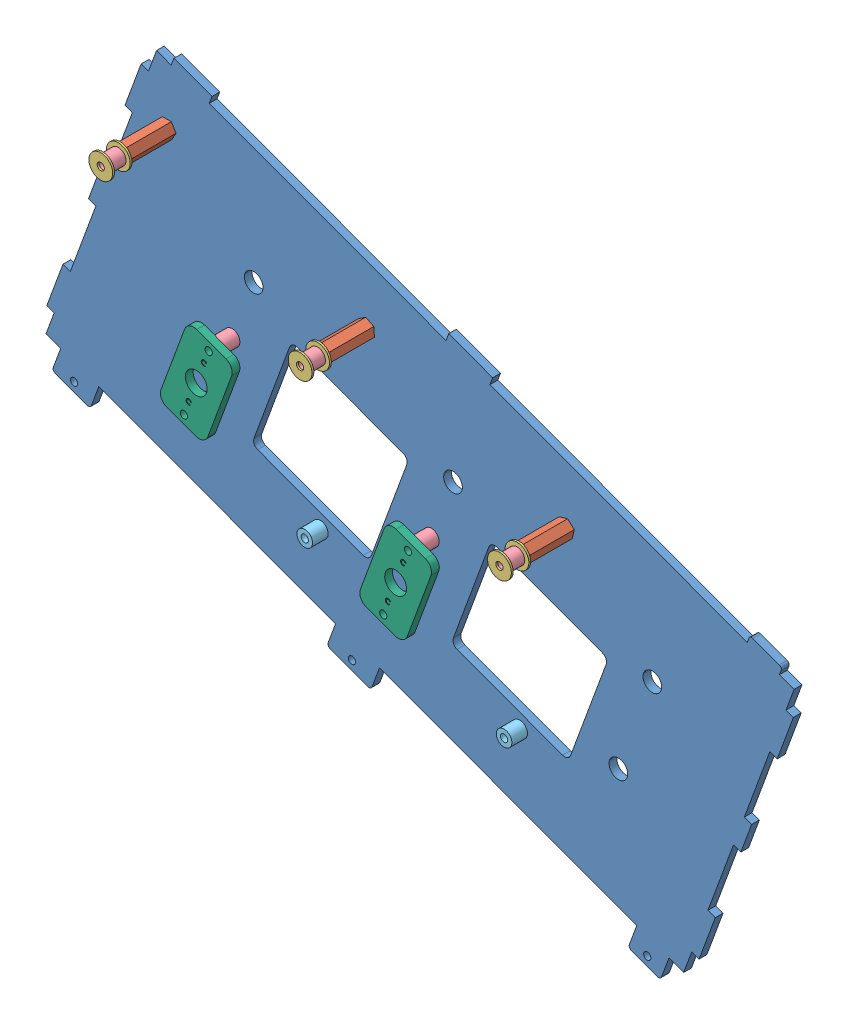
SolidWorks assembly Ratchets.SLDASM, configuration Default (file format 7000). Lengths in mm.
Overall size (314.7 232.09 30.1).
21 component instances, 6 part files, 31 mates.
Components (placement in the parent):
- MidPanel2-1: MidPanel2.SLDPRT [Default] at (22.2351 161.8968 243.2388) x (0.938568 -0.345094 0) z (0 0 1) size (282.58 143.38 3.18)
- Standoff-0p75in-1s4-2: Standoff-0p75in-1s4.SLDPRT [Default] at (71.4078 258.8325 265.4638) x (-0.999902 -0.013974 0) z (0.013974 -0.999902 0) size (7.33 19.05 6.35)
- Washer-0p38in-4: Washer-0p38in.SLDPRT [Default] at (71.4078 258.8325 265.4638) x (0.886945 0.461875 0) z (0 0 1) size (9.65 9.65 0.76)
- Spacer-0p25-1s4-1: Spacer-0p25-1s4.SLDPRT [Default] at (71.4078 258.8325 266.2258) x (0.918268 0.39596 0) z (0 0 1) size (6.35 6.35 6.35)
- Washer-0p38in-1: Washer-0p38in.SLDPRT [Default] at (71.4078 258.8325 272.5758) x (0.974797 -0.223092 0) z (0 0 1) size (9.65 9.65 0.76)
- Standoff-0p75in-1s4-1: Standoff-0p75in-1s4.SLDPRT [Default] at (152.4626 229.0302 265.4638) x (-0.830154 -0.557534 0) z (0.557534 -0.830154 0) size (7.33 19.05 6.35)
- Washer-0p38in-5: Washer-0p38in.SLDPRT [Default] at (152.4626 229.0302 265.4638) x (0.971362 -0.237603 0) z (0 0 1) size (9.65 9.65 0.76)
- Spacer-0p25-1s4-2: Spacer-0p25-1s4.SLDPRT [Default] at (152.4626 229.0302 266.2258) x (0.998153 0.060744 0) z (0 0 1) size (6.35 6.35 6.35)
- Washer-0p38in-2: Washer-0p38in.SLDPRT [Default] at (152.4626 229.0302 272.5758) x (0.964442 -0.264293 0) z (0 0 1) size (9.65 9.65 0.76)
- Standoff-0p75in-1s4-3: Standoff-0p75in-1s4.SLDPRT [Default] at (233.5173 199.2278 265.4638) x (0.732123 -0.681172 0) z (0.681172 0.732123 0) size (7.33 19.05 6.35)
- Washer-0p38in-6: Washer-0p38in.SLDPRT [Default] at (233.5173 199.2278 265.4638) x (0.998962 0.045555 0) z (0 0 1) size (9.65 9.65 0.76)
- Spacer-0p25-1s4-3: Spacer-0p25-1s4.SLDPRT [Default] at (233.5173 199.2278 266.2258) x (-0.1226 0.992456 0) z (0 0 1) size (6.35 6.35 6.35)
- Washer-0p38in-3: Washer-0p38in.SLDPRT [Default] at (233.5173 199.2278 272.5758) x (0.76285 -0.646575 0) z (0 0 1) size (9.65 9.65 0.76)
- Standoff-round-0p25in-1s4-3: Standoff-round-0p25in-1s4.SLDPRT [Default] at (133.7739 148.7604 246.4138) x (-0.853855 0.520511 0) z (0 0 1) size (6.35 6.35 6.35)
- Standoff-round-0p25in-1s4-4: Standoff-round-0p25in-1s4.SLDPRT [Default] at (214.8286 118.958 246.4138) x (-0.853855 0.520511 0) z (0 0 1) size (6.35 6.35 6.35)
- SautoirBacking-2: SautoirBacking.SLDPRT [Default] at (77.1723 171.4661 252.7638) x (0.938568 -0.345094 0) z (0 0 1) size (20.32 35.56 3.17)
- Spacer-0p25-1s4-4: Spacer-0p25-1s4.SLDPRT [Default] at (97.8841 198.3555 246.4138) size (6.35 6.35 6.35)
- Spacer-0p25-1s4-5: Spacer-0p25-1s4.SLDPRT [Default] at (87.8039 170.9399 246.4138) size (6.35 6.35 6.35)
- SautoirBacking-3: SautoirBacking.SLDPRT [Default] at (158.2271 141.6638 252.7638) x (0.938568 -0.345094 0) z (0 0 1) size (20.32 35.56 3.17)
- Spacer-0p25-1s4-6: Spacer-0p25-1s4.SLDPRT [Default] at (168.8586 141.1376 246.4138) size (6.35 6.35 6.35)
- Spacer-0p25-1s4-7: Spacer-0p25-1s4.SLDPRT [Default] at (178.9388 168.5531 246.4138) x (-0.849972 -0.526827 0) z (0 0 1) size (6.35 6.35 6.35)
Mates (geometry in assembly coordinates):
- Coincident11: coincident anti-aligned: plane of Standoff-0p75in-1s4-1 through (152.4626 229.0302 246.4138) normal (0 0 -1); plane of MidPanel2-1 through (22.2351 161.8968 246.4138) normal (0 0 1)
- Coincident12: coincident anti-aligned: plane of Standoff-0p75in-1s4-3 through (233.5173 199.2278 246.4138) normal (0 0 -1); plane of MidPanel2-1 through (22.2351 161.8968 246.4138) normal (0 0 1)
- Coincident14: coincident anti-aligned: plane of Standoff-0p75in-1s4-2 through (71.4078 258.8325 246.4138) normal (0 0 -1); plane of MidPanel2-1 through (22.2351 161.8968 246.4138) normal (0 0 1)
- Coincident15: coincident aligned: circle of Standoff-round-0p25in-1s4-3; circle of MidPanel2-1
- Coincident16: coincident aligned: circle of Standoff-round-0p25in-1s4-4; circle of MidPanel2-1
- Concentric12: concentric anti-aligned: circle of Spacer-0p25-1s4-1; circle of Standoff-0p75in-1s4-2
- Coincident19: coincident aligned: circle of Spacer-0p25-1s4-1; circle of Washer-0p38in-1
- Coincident20: coincident aligned: circle of Washer-0p38in-2; circle of Spacer-0p25-1s4-2
- Concentric13: concentric anti-aligned: circle of Standoff-0p75in-1s4-1; circle of Spacer-0p25-1s4-2
- Coincident22: coincident aligned: circle of Spacer-0p25-1s4-3; circle of Washer-0p38in-3
- Concentric14: concentric anti-aligned: circle of Standoff-0p75in-1s4-3; circle of Spacer-0p25-1s4-3
- Coincident24: coincident anti-aligned: circle of SautoirBacking-2; circle of Spacer-0p25-1s4-4
- Coincident25: coincident aligned: circle of MidPanel2-1; circle of Spacer-0p25-1s4-4
- Coincident26: coincident aligned: circle of MidPanel2-1; circle of Spacer-0p25-1s4-5
- Coincident27: coincident anti-aligned: circle of SautoirBacking-2; circle of Spacer-0p25-1s4-5
- Coincident28: coincident aligned: circle of MidPanel2-1; circle of Spacer-0p25-1s4-6
- Coincident29: coincident anti-aligned: circle of SautoirBacking-3; circle of Spacer-0p25-1s4-6
- Coincident32: coincident aligned: circle of MidPanel2-1; circle of Spacer-0p25-1s4-7
- Coincident33: coincident anti-aligned: circle of SautoirBacking-3; circle of Spacer-0p25-1s4-7
- Concentric15: concentric anti-aligned: circle of Standoff-0p75in-1s4-2; circle of Washer-0p38in-4
- Coincident34: coincident anti-aligned: plane of Standoff-0p75in-1s4-2 through (71.4078 258.8325 265.4638) normal (0 0 1); plane of Washer-0p38in-4 through (71.4078 258.8325 265.4638) normal (0 0 -1)
- Coincident35: coincident anti-aligned: plane of Spacer-0p25-1s4-1 through (71.4078 258.8325 266.2258) normal (0 0 -1); plane of Washer-0p38in-4 through (71.4078 258.8325 266.2258) normal (0 0 1)
- Concentric16: concentric anti-aligned: circle of Standoff-0p75in-1s4-1; circle of Washer-0p38in-5
- Coincident36: coincident anti-aligned: plane of Standoff-0p75in-1s4-1 through (152.4626 229.0302 265.4638) normal (0 0 1); plane of Washer-0p38in-5 through (152.4626 229.0302 265.4638) normal (0 0 -1)
- Coincident37: coincident anti-aligned: plane of Washer-0p38in-5 through (152.4626 229.0302 266.2258) normal (0 0 1); plane of Spacer-0p25-1s4-2 through (152.4626 229.0302 266.2258) normal (0 0 -1)
- Concentric17: concentric anti-aligned: circle of Standoff-0p75in-1s4-3; circle of Washer-0p38in-6
- Coincident38: coincident anti-aligned: plane of Standoff-0p75in-1s4-3 through (233.5173 199.2278 265.4638) normal (0 0 1); plane of Washer-0p38in-6 through (233.5173 199.2278 265.4638) normal (0 0 -1)
- Coincident39: coincident anti-aligned: plane of Spacer-0p25-1s4-3 through (233.5173 199.2278 266.2258) normal (0 0 -1); plane of Washer-0p38in-6 through (233.5173 199.2278 266.2258) normal (0 0 1)
- Concentric18: concentric anti-aligned: circle of MidPanel2-1; circle of Standoff-0p75in-1s4-2
- Concentric19: concentric anti-aligned: circle of MidPanel2-1; circle of Standoff-0p75in-1s4-1
- Concentric20: concentric anti-aligned: circle of MidPanel2-1; circle of Standoff-0p75in-1s4-3
